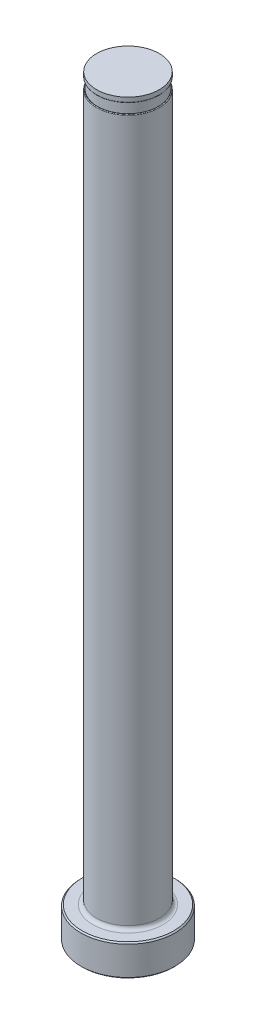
from build123d import *

# Parameters (mm, degrees)
CHAMFER1_SIZE     = 0.254
FILLET1_R         = 0.762
SKETCH2_W         = 0.2032
SKETCH2_H         = 2.032
D_SLOT_DEPTH      = 153.9941543
D_SLOT_DEPTH_BACK = 153.9941543
SKETCH5_W         = 0.00508
SKETCH5_H         = 1.016
FILLET2_R         = 0.127


with BuildPart() as part:
    # Sketch1 → Revolve1 (revolve)
    with BuildSketch(Plane.XY, mode=Mode.PRIVATE) as revolve1_sk:
        Polygon((0, 0), (-9.525, 0), (-9.525, 6.35), (-6.35, 6.35), (-6.35, 152.4), (0, 152.4), align=None)
    revolve(revolve1_sk.sketch.rotate(Axis((0, 259.958771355, 0), (0, -1, 0)), 270), axis=Axis((0, 259.958771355, 0), (0, -1, 0)))

    # Chamfer1
    chamfer1_edges = [part.edges().sort_by_distance(p)[0] for p in [
        (0, 6.35, -9.525),
        (0, 0, -9.525),
    ]]
    chamfer(chamfer1_edges, length=CHAMFER1_SIZE)

    # Fillet1
    fillet1_edges = [part.edges().sort_by_distance(p)[0] for p in [
        (0, 6.35, -6.35),
    ]]
    fillet(fillet1_edges, radius=FILLET1_R)

    # Sketch2 → Vent Relief (revolve, cut)
    with BuildSketch(Plane.XY, mode=Mode.PRIVATE) as vent_relief_sk:
        with Locations((-6.2484, 150.368)):
            Rectangle(SKETCH2_W, SKETCH2_H)
    revolve(vent_relief_sk.sketch.rotate(Axis((0, 153.448281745, 0), (0, -1, 0)), 270), axis=Axis((0, 153.448281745, 0), (0, -1, 0)), mode=Mode.SUBTRACT)

    # Sketch3 → D-Slot (cut, two sides: drawn at the far end of the back side and taken through both)
    with BuildSketch(Plane.XY.offset(-D_SLOT_DEPTH_BACK)):
        with BuildLine():
            Line((-6.1468, 150.368), (-6.1468, 86.868))
            ThreePointArc((-6.1468, 86.868), (-6.198013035, 86.300038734), (-6.35, 85.7504))
            Line((-6.35, 85.7504), (-6.35, 150.368))
            Line((-6.35, 150.368), (-6.1468, 150.368))
        make_face()
    extrude(amount=D_SLOT_DEPTH + D_SLOT_DEPTH_BACK, mode=Mode.SUBTRACT)

    # Sketch5 → Vent Diameter (revolve, cut)
    with BuildSketch(Plane.XY, mode=Mode.PRIVATE) as vent_diameter_sk:
        with Locations((-6.34746, 151.892)):
            Rectangle(SKETCH5_W, SKETCH5_H)
    revolve(vent_diameter_sk.sketch.rotate(Axis((0, 152.687735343, 0), (0, -1, 0)), 90), axis=Axis((0, 152.687735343, 0), (0, -1, 0)), mode=Mode.SUBTRACT)

    # Fillet2
    fillet2_edges = [part.edges().sort_by_distance(p)[0] for p in [
        (5.022023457, 149.352, -3.886100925),
        (0, 151.384, 6.34492),
    ]]
    fillet(fillet2_edges, radius=FILLET2_R)


solid = part.part
